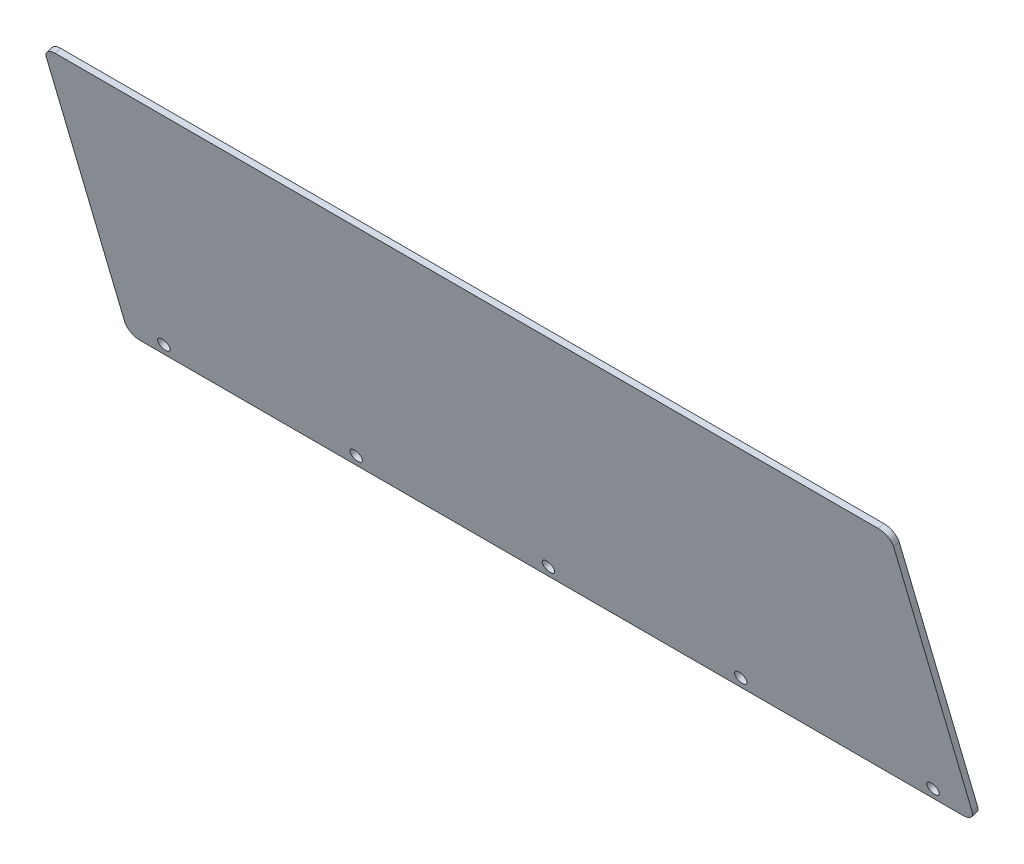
ISO-10303-21;
HEADER;
FILE_DESCRIPTION(('STEP AP214'),'2;1');
FILE_NAME('part.step','',(''),(''),'','','');
FILE_SCHEMA(('AUTOMOTIVE_DESIGN { 1 0 10303 214 1 1 1 1 }'));
ENDSEC;
DATA;
#1=APPLICATION_CONTEXT('core data for automotive mechanical design processes');
#2=APPLICATION_PROTOCOL_DEFINITION('international standard','automotive_design',2000,#1);
#3=PRODUCT_CONTEXT('',#1,'mechanical');
#4=PRODUCT('Part','Part','',(#3));
#5=PRODUCT_RELATED_PRODUCT_CATEGORY('part','',(#4));
#6=PRODUCT_DEFINITION_FORMATION('','',#4);
#7=PRODUCT_DEFINITION_CONTEXT('part definition',#1,'design');
#8=PRODUCT_DEFINITION('design','',#6,#7);
#9=PRODUCT_DEFINITION_SHAPE('','',#8);
#10=(LENGTH_UNIT() NAMED_UNIT(*) SI_UNIT(.MILLI.,.METRE.));
#11=(NAMED_UNIT(*) PLANE_ANGLE_UNIT() SI_UNIT($,.RADIAN.));
#12=(NAMED_UNIT(*) SI_UNIT($,.STERADIAN.) SOLID_ANGLE_UNIT());
#13=UNCERTAINTY_MEASURE_WITH_UNIT(LENGTH_MEASURE(1.E-05),#10,'distance_accuracy_value','');
#14=(GEOMETRIC_REPRESENTATION_CONTEXT(3) GLOBAL_UNCERTAINTY_ASSIGNED_CONTEXT((#13)) GLOBAL_UNIT_ASSIGNED_CONTEXT((#10,
#11,#12)) REPRESENTATION_CONTEXT('',''));
#15=CARTESIAN_POINT('',(0.,0.,0.));
#16=DIRECTION('',(0.,0.,1.));
#17=DIRECTION('',(1.,0.,0.));
#18=AXIS2_PLACEMENT_3D('',#15,#16,#17);
#19=CARTESIAN_POINT('',(-101.6,162.271695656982,226.510474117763));
#20=DIRECTION('',(0.,0.280438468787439,-0.959872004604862));
#21=DIRECTION('',(0.,0.959872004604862,0.280438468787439));
#22=AXIS2_PLACEMENT_3D('',#19,#20,#21);
#23=CYLINDRICAL_SURFACE('',#22,3.175);
#24=CARTESIAN_POINT('',(-101.6,163.112225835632,223.633545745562));
#25=DIRECTION('',(0.,0.280438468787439,-0.959872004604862));
#26=DIRECTION('',(0.,-0.959872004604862,-0.280438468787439));
#27=AXIS2_PLACEMENT_3D('',#24,#25,#26);
#28=CIRCLE('',#27,3.175);
#29=CARTESIAN_POINT('',(-101.6,160.064632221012,222.743153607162));
#30=VERTEX_POINT('',#29);
#31=EDGE_CURVE('E183',#30,#30,#28,.T.);
#32=ORIENTED_EDGE('',*,*,#31,.T.);
#33=EDGE_LOOP('',(#32));
#34=FACE_BOUND('',#33,.T.);
#35=CARTESIAN_POINT('',(-101.6,162.271695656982,226.510474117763));
#36=DIRECTION('',(0.,0.280438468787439,-0.959872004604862));
#37=DIRECTION('',(0.,0.959872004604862,0.280438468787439));
#38=AXIS2_PLACEMENT_3D('',#35,#36,#37);
#39=CIRCLE('',#38,3.175);
#40=CARTESIAN_POINT('',(-101.6,165.319289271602,227.400866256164));
#41=VERTEX_POINT('',#40);
#42=EDGE_CURVE('E258',#41,#41,#39,.T.);
#43=ORIENTED_EDGE('',*,*,#42,.F.);
#44=EDGE_LOOP('',(#43));
#45=FACE_BOUND('',#44,.T.);
#46=ADVANCED_FACE('F17',(#34,#45),#23,.F.);
#47=CARTESIAN_POINT('',(0.,162.271695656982,226.510474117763));
#48=DIRECTION('',(0.,0.280438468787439,-0.959872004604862));
#49=DIRECTION('',(0.,0.959872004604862,0.280438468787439));
#50=AXIS2_PLACEMENT_3D('',#47,#48,#49);
#51=CYLINDRICAL_SURFACE('',#50,3.175);
#52=CARTESIAN_POINT('',(0.,163.112225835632,223.633545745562));
#53=DIRECTION('',(0.,0.280438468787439,-0.959872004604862));
#54=DIRECTION('',(0.,-0.959872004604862,-0.280438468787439));
#55=AXIS2_PLACEMENT_3D('',#52,#53,#54);
#56=CIRCLE('',#55,3.175);
#57=CARTESIAN_POINT('',(0.,160.064632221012,222.743153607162));
#58=VERTEX_POINT('',#57);
#59=EDGE_CURVE('E186',#58,#58,#56,.T.);
#60=ORIENTED_EDGE('',*,*,#59,.T.);
#61=EDGE_LOOP('',(#60));
#62=FACE_BOUND('',#61,.T.);
#63=CARTESIAN_POINT('',(0.,162.271695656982,226.510474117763));
#64=DIRECTION('',(0.,0.280438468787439,-0.959872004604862));
#65=DIRECTION('',(0.,0.959872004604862,0.280438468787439));
#66=AXIS2_PLACEMENT_3D('',#63,#64,#65);
#67=CIRCLE('',#66,3.175);
#68=CARTESIAN_POINT('',(0.,165.319289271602,227.400866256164));
#69=VERTEX_POINT('',#68);
#70=EDGE_CURVE('E261',#69,#69,#67,.T.);
#71=ORIENTED_EDGE('',*,*,#70,.F.);
#72=EDGE_LOOP('',(#71));
#73=FACE_BOUND('',#72,.T.);
#74=ADVANCED_FACE('F309',(#62,#73),#51,.F.);
#75=CARTESIAN_POINT('',(203.2,162.271695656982,226.510474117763));
#76=DIRECTION('',(0.,0.280438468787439,-0.959872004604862));
#77=DIRECTION('',(0.,0.959872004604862,0.280438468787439));
#78=AXIS2_PLACEMENT_3D('',#75,#76,#77);
#79=CYLINDRICAL_SURFACE('',#78,3.175);
#80=CARTESIAN_POINT('',(203.2,163.112225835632,223.633545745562));
#81=DIRECTION('',(0.,0.280438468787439,-0.959872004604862));
#82=DIRECTION('',(0.,-0.959872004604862,-0.280438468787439));
#83=AXIS2_PLACEMENT_3D('',#80,#81,#82);
#84=CIRCLE('',#83,3.175);
#85=CARTESIAN_POINT('',(203.2,160.064632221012,222.743153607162));
#86=VERTEX_POINT('',#85);
#87=EDGE_CURVE('E249',#86,#86,#84,.T.);
#88=ORIENTED_EDGE('',*,*,#87,.T.);
#89=EDGE_LOOP('',(#88));
#90=FACE_BOUND('',#89,.T.);
#91=CARTESIAN_POINT('',(203.2,162.271695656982,226.510474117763));
#92=DIRECTION('',(0.,0.280438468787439,-0.959872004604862));
#93=DIRECTION('',(0.,0.959872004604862,0.280438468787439));
#94=AXIS2_PLACEMENT_3D('',#91,#92,#93);
#95=CIRCLE('',#94,3.175);
#96=CARTESIAN_POINT('',(203.2,165.319289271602,227.400866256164));
#97=VERTEX_POINT('',#96);
#98=EDGE_CURVE('E264',#97,#97,#95,.T.);
#99=ORIENTED_EDGE('',*,*,#98,.F.);
#100=EDGE_LOOP('',(#99));
#101=FACE_BOUND('',#100,.T.);
#102=ADVANCED_FACE('F19',(#90,#101),#79,.F.);
#103=CARTESIAN_POINT('',(-203.2,162.271695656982,226.510474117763));
#104=DIRECTION('',(0.,0.280438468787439,-0.959872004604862));
#105=DIRECTION('',(0.,0.959872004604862,0.280438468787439));
#106=AXIS2_PLACEMENT_3D('',#103,#104,#105);
#107=CYLINDRICAL_SURFACE('',#106,3.175);
#108=CARTESIAN_POINT('',(-203.2,163.112225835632,223.633545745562));
#109=DIRECTION('',(0.,0.280438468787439,-0.959872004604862));
#110=DIRECTION('',(0.,-0.959872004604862,-0.280438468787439));
#111=AXIS2_PLACEMENT_3D('',#108,#109,#110);
#112=CIRCLE('',#111,3.175);
#113=CARTESIAN_POINT('',(-203.2,160.064632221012,222.743153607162));
#114=VERTEX_POINT('',#113);
#115=EDGE_CURVE('E252',#114,#114,#112,.T.);
#116=ORIENTED_EDGE('',*,*,#115,.T.);
#117=EDGE_LOOP('',(#116));
#118=FACE_BOUND('',#117,.T.);
#119=CARTESIAN_POINT('',(-203.2,162.271695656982,226.510474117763));
#120=DIRECTION('',(0.,0.280438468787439,-0.959872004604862));
#121=DIRECTION('',(0.,0.959872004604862,0.280438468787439));
#122=AXIS2_PLACEMENT_3D('',#119,#120,#121);
#123=CIRCLE('',#122,3.175);
#124=CARTESIAN_POINT('',(-203.2,165.319289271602,227.400866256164));
#125=VERTEX_POINT('',#124);
#126=EDGE_CURVE('E26',#125,#125,#123,.T.);
#127=ORIENTED_EDGE('',*,*,#126,.F.);
#128=EDGE_LOOP('',(#127));
#129=FACE_BOUND('',#128,.T.);
#130=ADVANCED_FACE('F340',(#118,#129),#107,.F.);
#131=CARTESIAN_POINT('',(101.6,162.271695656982,226.510474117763));
#132=DIRECTION('',(0.,0.280438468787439,-0.959872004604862));
#133=DIRECTION('',(0.,0.959872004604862,0.280438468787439));
#134=AXIS2_PLACEMENT_3D('',#131,#132,#133);
#135=CYLINDRICAL_SURFACE('',#134,3.175);
#136=CARTESIAN_POINT('',(101.6,163.112225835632,223.633545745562));
#137=DIRECTION('',(0.,0.280438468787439,-0.959872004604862));
#138=DIRECTION('',(0.,-0.959872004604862,-0.280438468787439));
#139=AXIS2_PLACEMENT_3D('',#136,#137,#138);
#140=CIRCLE('',#139,3.175);
#141=CARTESIAN_POINT('',(101.6,160.064632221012,222.743153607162));
#142=VERTEX_POINT('',#141);
#143=EDGE_CURVE('E255',#142,#142,#140,.T.);
#144=ORIENTED_EDGE('',*,*,#143,.T.);
#145=EDGE_LOOP('',(#144));
#146=FACE_BOUND('',#145,.T.);
#147=CARTESIAN_POINT('',(101.6,162.271695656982,226.510474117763));
#148=DIRECTION('',(0.,0.280438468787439,-0.959872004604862));
#149=DIRECTION('',(0.,0.959872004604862,0.280438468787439));
#150=AXIS2_PLACEMENT_3D('',#147,#148,#149);
#151=CIRCLE('',#150,3.175);
#152=CARTESIAN_POINT('',(101.6,165.319289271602,227.400866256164));
#153=VERTEX_POINT('',#152);
#154=EDGE_CURVE('E11',#153,#153,#151,.T.);
#155=ORIENTED_EDGE('',*,*,#154,.F.);
#156=EDGE_LOOP('',(#155));
#157=FACE_BOUND('',#156,.T.);
#158=ADVANCED_FACE('F336',(#146,#157),#135,.F.);
#159=CARTESIAN_POINT('',(1.11022302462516E-13,92.3998495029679,206.096550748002));
#160=DIRECTION('',(0.,-0.280438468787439,0.959872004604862));
#161=DIRECTION('',(-1.,0.,0.));
#162=AXIS2_PLACEMENT_3D('',#159,#160,#161);
#163=PLANE('',#162);
#164=DIRECTION('',(0.,-0.959872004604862,-0.280438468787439));
#165=VECTOR('',#164,1.);
#166=CARTESIAN_POINT('',(223.8375,233.136503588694,247.214503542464));
#167=LINE('',#166,#165);
#168=CARTESIAN_POINT('',(223.8375,304.001311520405,267.918532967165));
#169=VERTEX_POINT('',#168);
#170=CARTESIAN_POINT('',(223.8375,162.271695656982,226.510474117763));
#171=VERTEX_POINT('',#170);
#172=EDGE_CURVE('E159',#169,#171,#167,.T.);
#173=ORIENTED_EDGE('',*,*,#172,.F.);
#174=CARTESIAN_POINT('',(217.4875,304.001311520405,267.918532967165));
#175=DIRECTION('',(0.,-0.280438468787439,0.959872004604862));
#176=DIRECTION('',(0.,-0.959872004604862,-0.280438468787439));
#177=AXIS2_PLACEMENT_3D('',#174,#175,#176);
#178=CIRCLE('',#177,6.35000000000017);
#179=CARTESIAN_POINT('',(217.4875,310.096498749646,269.699317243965));
#180=VERTEX_POINT('',#179);
#181=EDGE_CURVE('E141',#169,#180,#178,.T.);
#182=ORIENTED_EDGE('',*,*,#181,.T.);
#183=DIRECTION('',(1.,0.,0.));
#184=VECTOR('',#183,1.);
#185=CARTESIAN_POINT('',(1.11022302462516E-13,310.096498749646,269.699317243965));
#186=LINE('',#185,#184);
#187=CARTESIAN_POINT('',(-217.4875,310.096498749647,269.699317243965));
#188=VERTEX_POINT('',#187);
#189=EDGE_CURVE('E177',#188,#180,#186,.T.);
#190=ORIENTED_EDGE('',*,*,#189,.F.);
#191=CARTESIAN_POINT('',(-217.4875,304.001311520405,267.918532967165));
#192=DIRECTION('',(0.,-0.280438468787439,0.959872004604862));
#193=DIRECTION('',(0.,-0.959872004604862,-0.280438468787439));
#194=AXIS2_PLACEMENT_3D('',#191,#192,#193);
#195=CIRCLE('',#194,6.35000000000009);
#196=CARTESIAN_POINT('',(-223.8375,304.001311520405,267.918532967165));
#197=VERTEX_POINT('',#196);
#198=EDGE_CURVE('E213',#188,#197,#195,.T.);
#199=ORIENTED_EDGE('',*,*,#198,.T.);
#200=DIRECTION('',(0.,-0.959872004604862,-0.280438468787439));
#201=VECTOR('',#200,1.);
#202=CARTESIAN_POINT('',(-223.8375,233.136503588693,247.214503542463));
#203=LINE('',#202,#201);
#204=CARTESIAN_POINT('',(-223.8375,162.271695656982,226.510474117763));
#205=VERTEX_POINT('',#204);
#206=EDGE_CURVE('E205',#197,#205,#203,.T.);
#207=ORIENTED_EDGE('',*,*,#206,.T.);
#208=CARTESIAN_POINT('',(-217.4875,162.271695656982,226.510474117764));
#209=DIRECTION('',(0.,-0.280438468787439,0.959872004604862));
#210=DIRECTION('',(0.,-0.959872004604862,-0.280438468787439));
#211=AXIS2_PLACEMENT_3D('',#208,#209,#210);
#212=CIRCLE('',#211,6.35000000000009);
#213=CARTESIAN_POINT('',(-217.4875,156.176508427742,224.729689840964));
#214=VERTEX_POINT('',#213);
#215=EDGE_CURVE('E191',#205,#214,#212,.T.);
#216=ORIENTED_EDGE('',*,*,#215,.T.);
#217=DIRECTION('',(1.,0.,0.));
#218=VECTOR('',#217,1.);
#219=CARTESIAN_POINT('',(1.66533453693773E-13,156.176508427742,224.729689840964));
#220=LINE('',#219,#218);
#221=CARTESIAN_POINT('',(217.4875,156.176508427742,224.729689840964));
#222=VERTEX_POINT('',#221);
#223=EDGE_CURVE('E235',#214,#222,#220,.T.);
#224=ORIENTED_EDGE('',*,*,#223,.T.);
#225=CARTESIAN_POINT('',(217.4875,162.271695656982,226.510474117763));
#226=DIRECTION('',(0.,-0.280438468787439,0.959872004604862));
#227=DIRECTION('',(0.,-0.959872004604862,-0.280438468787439));
#228=AXIS2_PLACEMENT_3D('',#225,#226,#227);
#229=CIRCLE('',#228,6.3500000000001);
#230=EDGE_CURVE('E166',#222,#171,#229,.T.);
#231=ORIENTED_EDGE('',*,*,#230,.T.);
#232=EDGE_LOOP('',(#173,#182,#190,#199,#207,#216,#224,#231));
#233=FACE_BOUND('',#232,.T.);
#234=ORIENTED_EDGE('',*,*,#154,.T.);
#235=EDGE_LOOP('',(#234));
#236=FACE_BOUND('',#235,.T.);
#237=ORIENTED_EDGE('',*,*,#126,.T.);
#238=EDGE_LOOP('',(#237));
#239=FACE_BOUND('',#238,.T.);
#240=ORIENTED_EDGE('',*,*,#98,.T.);
#241=EDGE_LOOP('',(#240));
#242=FACE_BOUND('',#241,.T.);
#243=ORIENTED_EDGE('',*,*,#70,.T.);
#244=EDGE_LOOP('',(#243));
#245=FACE_BOUND('',#244,.T.);
#246=ORIENTED_EDGE('',*,*,#42,.T.);
#247=EDGE_LOOP('',(#246));
#248=FACE_BOUND('',#247,.T.);
#249=ADVANCED_FACE('F164',(#233,#236,#239,#242,#245,#248),#163,.T.);
#250=CARTESIAN_POINT('',(1.11022302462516E-13,93.2403796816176,203.2196223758));
#251=DIRECTION('',(0.,-0.280438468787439,0.959872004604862));
#252=DIRECTION('',(-1.,0.,0.));
#253=AXIS2_PLACEMENT_3D('',#250,#251,#252);
#254=PLANE('',#253);
#255=DIRECTION('',(0.,-0.959872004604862,-0.280438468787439));
#256=VECTOR('',#255,1.);
#257=CARTESIAN_POINT('',(223.8375,233.977033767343,244.337575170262));
#258=LINE('',#257,#256);
#259=CARTESIAN_POINT('',(223.8375,304.841841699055,265.041604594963));
#260=VERTEX_POINT('',#259);
#261=CARTESIAN_POINT('',(223.8375,163.112225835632,223.633545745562));
#262=VERTEX_POINT('',#261);
#263=EDGE_CURVE('E161',#260,#262,#258,.T.);
#264=ORIENTED_EDGE('',*,*,#263,.T.);
#265=CARTESIAN_POINT('',(217.4875,163.112225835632,223.633545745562));
#266=DIRECTION('',(0.,-0.280438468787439,0.959872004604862));
#267=DIRECTION('',(0.,-0.959872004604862,-0.280438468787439));
#268=AXIS2_PLACEMENT_3D('',#265,#266,#267);
#269=CIRCLE('',#268,6.3500000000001);
#270=CARTESIAN_POINT('',(217.4875,157.017038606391,221.852761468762));
#271=VERTEX_POINT('',#270);
#272=EDGE_CURVE('E187',#271,#262,#269,.T.);
#273=ORIENTED_EDGE('',*,*,#272,.F.);
#274=DIRECTION('',(1.,0.,0.));
#275=VECTOR('',#274,1.);
#276=CARTESIAN_POINT('',(1.66533453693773E-13,157.017038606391,221.852761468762));
#277=LINE('',#276,#275);
#278=CARTESIAN_POINT('',(-217.4875,157.017038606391,221.852761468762));
#279=VERTEX_POINT('',#278);
#280=EDGE_CURVE('E238',#279,#271,#277,.T.);
#281=ORIENTED_EDGE('',*,*,#280,.F.);
#282=CARTESIAN_POINT('',(-217.4875,163.112225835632,223.633545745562));
#283=DIRECTION('',(0.,-0.280438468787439,0.959872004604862));
#284=DIRECTION('',(0.,-0.959872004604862,-0.280438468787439));
#285=AXIS2_PLACEMENT_3D('',#282,#283,#284);
#286=CIRCLE('',#285,6.35000000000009);
#287=CARTESIAN_POINT('',(-223.8375,163.112225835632,223.633545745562));
#288=VERTEX_POINT('',#287);
#289=EDGE_CURVE('E194',#288,#279,#286,.T.);
#290=ORIENTED_EDGE('',*,*,#289,.F.);
#291=DIRECTION('',(0.,-0.959872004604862,-0.280438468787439));
#292=VECTOR('',#291,1.);
#293=CARTESIAN_POINT('',(-223.8375,233.977033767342,244.337575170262));
#294=LINE('',#293,#292);
#295=CARTESIAN_POINT('',(-223.8375,304.841841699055,265.041604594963));
#296=VERTEX_POINT('',#295);
#297=EDGE_CURVE('E192',#296,#288,#294,.T.);
#298=ORIENTED_EDGE('',*,*,#297,.F.);
#299=CARTESIAN_POINT('',(-217.4875,304.841841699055,265.041604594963));
#300=DIRECTION('',(0.,-0.280438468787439,0.959872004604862));
#301=DIRECTION('',(0.,-0.959872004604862,-0.280438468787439));
#302=AXIS2_PLACEMENT_3D('',#299,#300,#301);
#303=CIRCLE('',#302,6.35000000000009);
#304=CARTESIAN_POINT('',(-217.4875,310.937028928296,266.822388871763));
#305=VERTEX_POINT('',#304);
#306=EDGE_CURVE('E206',#305,#296,#303,.T.);
#307=ORIENTED_EDGE('',*,*,#306,.F.);
#308=DIRECTION('',(1.,0.,0.));
#309=VECTOR('',#308,1.);
#310=CARTESIAN_POINT('',(1.11022302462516E-13,310.937028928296,266.822388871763));
#311=LINE('',#310,#309);
#312=CARTESIAN_POINT('',(217.4875,310.937028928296,266.822388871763));
#313=VERTEX_POINT('',#312);
#314=EDGE_CURVE('E180',#305,#313,#311,.T.);
#315=ORIENTED_EDGE('',*,*,#314,.T.);
#316=CARTESIAN_POINT('',(217.4875,304.841841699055,265.041604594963));
#317=DIRECTION('',(0.,-0.280438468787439,0.959872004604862));
#318=DIRECTION('',(0.,-0.959872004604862,-0.280438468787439));
#319=AXIS2_PLACEMENT_3D('',#316,#317,#318);
#320=CIRCLE('',#319,6.35000000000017);
#321=EDGE_CURVE('E153',#260,#313,#320,.T.);
#322=ORIENTED_EDGE('',*,*,#321,.F.);
#323=EDGE_LOOP('',(#264,#273,#281,#290,#298,#307,#315,#322));
#324=FACE_BOUND('',#323,.T.);
#325=ORIENTED_EDGE('',*,*,#143,.F.);
#326=EDGE_LOOP('',(#325));
#327=FACE_BOUND('',#326,.T.);
#328=ORIENTED_EDGE('',*,*,#115,.F.);
#329=EDGE_LOOP('',(#328));
#330=FACE_BOUND('',#329,.T.);
#331=ORIENTED_EDGE('',*,*,#87,.F.);
#332=EDGE_LOOP('',(#331));
#333=FACE_BOUND('',#332,.T.);
#334=ORIENTED_EDGE('',*,*,#59,.F.);
#335=EDGE_LOOP('',(#334));
#336=FACE_BOUND('',#335,.T.);
#337=ORIENTED_EDGE('',*,*,#31,.F.);
#338=EDGE_LOOP('',(#337));
#339=FACE_BOUND('',#338,.T.);
#340=ADVANCED_FACE('F348',(#324,#327,#330,#333,#336,#339),#254,.F.);
#341=CARTESIAN_POINT('',(217.4875,163.112225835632,223.633545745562));
#342=DIRECTION('',(0.,-0.280438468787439,0.959872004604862));
#343=DIRECTION('',(0.,-0.959872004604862,-0.280438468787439));
#344=AXIS2_PLACEMENT_3D('',#341,#342,#343);
#345=CYLINDRICAL_SURFACE('',#344,6.3500000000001);
#346=ORIENTED_EDGE('',*,*,#230,.F.);
#347=DIRECTION('',(0.,-0.280438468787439,0.959872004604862));
#348=VECTOR('',#347,1.);
#349=CARTESIAN_POINT('',(217.4875,157.017038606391,221.852761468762));
#350=LINE('',#349,#348);
#351=EDGE_CURVE('E228',#271,#222,#350,.T.);
#352=ORIENTED_EDGE('',*,*,#351,.F.);
#353=ORIENTED_EDGE('',*,*,#272,.T.);
#354=DIRECTION('',(0.,-0.280438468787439,0.959872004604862));
#355=VECTOR('',#354,1.);
#356=CARTESIAN_POINT('',(223.8375,163.112225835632,223.633545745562));
#357=LINE('',#356,#355);
#358=EDGE_CURVE('E169',#262,#171,#357,.T.);
#359=ORIENTED_EDGE('',*,*,#358,.T.);
#360=EDGE_LOOP('',(#346,#352,#353,#359));
#361=FACE_BOUND('',#360,.T.);
#362=ADVANCED_FACE('F286',(#361),#345,.T.);
#363=CARTESIAN_POINT('',(1.66533453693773E-13,157.017038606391,221.852761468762));
#364=DIRECTION('',(0.,-0.959872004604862,-0.280438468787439));
#365=DIRECTION('',(0.,0.280438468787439,-0.959872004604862));
#366=AXIS2_PLACEMENT_3D('',#363,#364,#365);
#367=PLANE('',#366);
#368=ORIENTED_EDGE('',*,*,#223,.F.);
#369=DIRECTION('',(0.,-0.280438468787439,0.959872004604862));
#370=VECTOR('',#369,1.);
#371=CARTESIAN_POINT('',(-217.4875,157.017038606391,221.852761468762));
#372=LINE('',#371,#370);
#373=EDGE_CURVE('E197',#279,#214,#372,.T.);
#374=ORIENTED_EDGE('',*,*,#373,.F.);
#375=ORIENTED_EDGE('',*,*,#280,.T.);
#376=ORIENTED_EDGE('',*,*,#351,.T.);
#377=EDGE_LOOP('',(#368,#374,#375,#376));
#378=FACE_BOUND('',#377,.T.);
#379=ADVANCED_FACE('F281',(#378),#367,.T.);
#380=CARTESIAN_POINT('',(-217.4875,163.112225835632,223.633545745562));
#381=DIRECTION('',(0.,-0.280438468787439,0.959872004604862));
#382=DIRECTION('',(0.,-0.959872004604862,-0.280438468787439));
#383=AXIS2_PLACEMENT_3D('',#380,#381,#382);
#384=CYLINDRICAL_SURFACE('',#383,6.35000000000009);
#385=ORIENTED_EDGE('',*,*,#215,.F.);
#386=DIRECTION('',(0.,-0.280438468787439,0.959872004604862));
#387=VECTOR('',#386,1.);
#388=CARTESIAN_POINT('',(-223.8375,163.112225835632,223.633545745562));
#389=LINE('',#388,#387);
#390=EDGE_CURVE('E188',#288,#205,#389,.T.);
#391=ORIENTED_EDGE('',*,*,#390,.F.);
#392=ORIENTED_EDGE('',*,*,#289,.T.);
#393=ORIENTED_EDGE('',*,*,#373,.T.);
#394=EDGE_LOOP('',(#385,#391,#392,#393));
#395=FACE_BOUND('',#394,.T.);
#396=ADVANCED_FACE('F285',(#395),#384,.T.);
#397=CARTESIAN_POINT('',(-223.8375,233.977033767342,244.337575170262));
#398=DIRECTION('',(-1.,0.,0.));
#399=DIRECTION('',(0.,1.,0.));
#400=AXIS2_PLACEMENT_3D('',#397,#398,#399);
#401=PLANE('',#400);
#402=ORIENTED_EDGE('',*,*,#206,.F.);
#403=DIRECTION('',(0.,-0.280438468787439,0.959872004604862));
#404=VECTOR('',#403,1.);
#405=CARTESIAN_POINT('',(-223.8375,304.841841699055,265.041604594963));
#406=LINE('',#405,#404);
#407=EDGE_CURVE('E201',#296,#197,#406,.T.);
#408=ORIENTED_EDGE('',*,*,#407,.F.);
#409=ORIENTED_EDGE('',*,*,#297,.T.);
#410=ORIENTED_EDGE('',*,*,#390,.T.);
#411=EDGE_LOOP('',(#402,#408,#409,#410));
#412=FACE_BOUND('',#411,.T.);
#413=ADVANCED_FACE('F317',(#412),#401,.T.);
#414=CARTESIAN_POINT('',(-217.4875,304.841841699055,265.041604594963));
#415=DIRECTION('',(0.,-0.280438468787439,0.959872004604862));
#416=DIRECTION('',(0.,-0.959872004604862,-0.280438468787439));
#417=AXIS2_PLACEMENT_3D('',#414,#415,#416);
#418=CYLINDRICAL_SURFACE('',#417,6.35000000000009);
#419=ORIENTED_EDGE('',*,*,#198,.F.);
#420=DIRECTION('',(0.,-0.280438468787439,0.959872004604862));
#421=VECTOR('',#420,1.);
#422=CARTESIAN_POINT('',(-217.4875,310.937028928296,266.822388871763));
#423=LINE('',#422,#421);
#424=EDGE_CURVE('E209',#305,#188,#423,.T.);
#425=ORIENTED_EDGE('',*,*,#424,.F.);
#426=ORIENTED_EDGE('',*,*,#306,.T.);
#427=ORIENTED_EDGE('',*,*,#407,.T.);
#428=EDGE_LOOP('',(#419,#425,#426,#427));
#429=FACE_BOUND('',#428,.T.);
#430=ADVANCED_FACE('F301',(#429),#418,.T.);
#431=CARTESIAN_POINT('',(1.11022302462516E-13,310.937028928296,266.822388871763));
#432=DIRECTION('',(0.,-0.959872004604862,-0.280438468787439));
#433=DIRECTION('',(0.,0.280438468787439,-0.959872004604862));
#434=AXIS2_PLACEMENT_3D('',#431,#432,#433);
#435=PLANE('',#434);
#436=ORIENTED_EDGE('',*,*,#189,.T.);
#437=DIRECTION('',(0.,-0.280438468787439,0.959872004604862));
#438=VECTOR('',#437,1.);
#439=CARTESIAN_POINT('',(217.4875,310.937028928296,266.822388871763));
#440=LINE('',#439,#438);
#441=EDGE_CURVE('E148',#313,#180,#440,.T.);
#442=ORIENTED_EDGE('',*,*,#441,.F.);
#443=ORIENTED_EDGE('',*,*,#314,.F.);
#444=ORIENTED_EDGE('',*,*,#424,.T.);
#445=EDGE_LOOP('',(#436,#442,#443,#444));
#446=FACE_BOUND('',#445,.T.);
#447=ADVANCED_FACE('F294',(#446),#435,.F.);
#448=CARTESIAN_POINT('',(217.4875,304.841841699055,265.041604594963));
#449=DIRECTION('',(0.,-0.280438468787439,0.959872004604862));
#450=DIRECTION('',(0.,-0.959872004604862,-0.280438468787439));
#451=AXIS2_PLACEMENT_3D('',#448,#449,#450);
#452=CYLINDRICAL_SURFACE('',#451,6.35000000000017);
#453=ORIENTED_EDGE('',*,*,#181,.F.);
#454=DIRECTION('',(0.,-0.280438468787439,0.959872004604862));
#455=VECTOR('',#454,1.);
#456=CARTESIAN_POINT('',(223.8375,304.841841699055,265.041604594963));
#457=LINE('',#456,#455);
#458=EDGE_CURVE('E145',#260,#169,#457,.T.);
#459=ORIENTED_EDGE('',*,*,#458,.F.);
#460=ORIENTED_EDGE('',*,*,#321,.T.);
#461=ORIENTED_EDGE('',*,*,#441,.T.);
#462=EDGE_LOOP('',(#453,#459,#460,#461));
#463=FACE_BOUND('',#462,.T.);
#464=ADVANCED_FACE('F143',(#463),#452,.T.);
#465=CARTESIAN_POINT('',(223.8375,233.977033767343,244.337575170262));
#466=DIRECTION('',(-1.,0.,0.));
#467=DIRECTION('',(0.,0.,1.));
#468=AXIS2_PLACEMENT_3D('',#465,#466,#467);
#469=PLANE('',#468);
#470=ORIENTED_EDGE('',*,*,#172,.T.);
#471=ORIENTED_EDGE('',*,*,#358,.F.);
#472=ORIENTED_EDGE('',*,*,#263,.F.);
#473=ORIENTED_EDGE('',*,*,#458,.T.);
#474=EDGE_LOOP('',(#470,#471,#472,#473));
#475=FACE_BOUND('',#474,.T.);
#476=ADVANCED_FACE('F157',(#475),#469,.F.);
#477=CLOSED_SHELL('',(#46,#74,#102,#130,#158,#249,#340,#362,#379,#396,#413,#430,#447,#464,#476));
#478=MANIFOLD_SOLID_BREP('B1',#477);
#479=ADVANCED_BREP_SHAPE_REPRESENTATION('',(#18,#478),#14);
#480=SHAPE_DEFINITION_REPRESENTATION(#9,#479);
ENDSEC;
END-ISO-10303-21;
